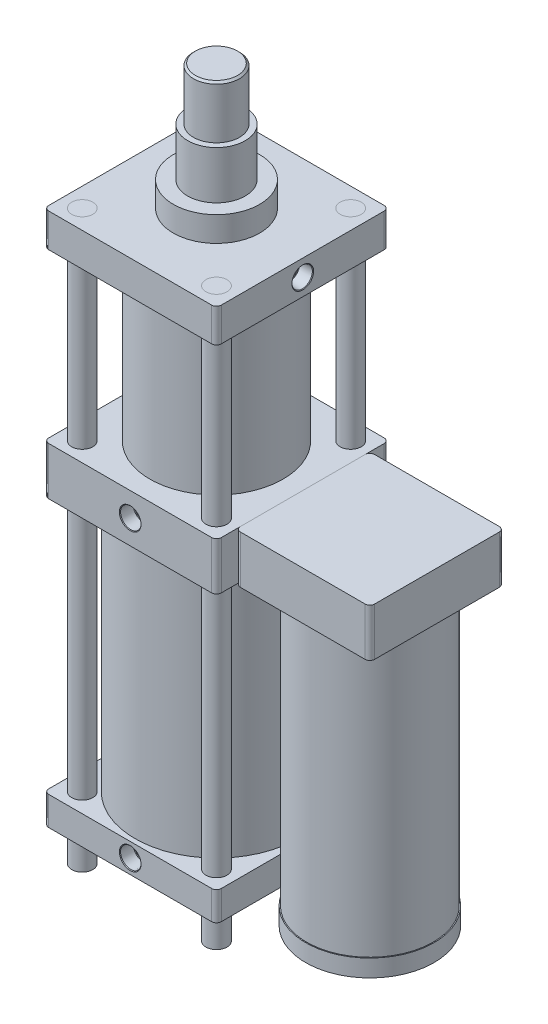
from build123d import *

# Parameters (mm, degrees)
SKETCH_1_R              = 11
EXTRUDE_1_DEPTH         = 35
SKETCH_2_R              = 45
EXTRUDE_2_DEPTH         = 26
SKETCH_3_R              = 30
EXTRUDE_3_DEPTH         = 50
SKETCH_4_R              = 24
EXTRUDE_4_DEPTH         = 55
CHAMFER_1_SIZE          = 2
SKETCH_5_R              = 69.5
EXTRUDE_5_DEPTH         = 175
EXTRUDE_START           = 50
SKETCH_6_R              = 11
EXTRUDE_6_DEPTH         = 50
SKETCH_7_R              = 85
EXTRUDE_7_DEPTH         = 267
EXTRUDE_START_2         = 30
SKETCH_8_R              = 11
EXTRUDE_8_DEPTH         = 30
EXTRUDE_9_DEPTH         = 50
SKETCH_10_R             = 66
EXTRUDE_10_DEPTH        = 290
SKETCH_11_R             = 67
EXTRUDE_11_DEPTH        = 18
EXTRUDE_12_DEPTH        = 12
EXTRUDE_13_DEPTH        = 35
EXTRUDE_13_DEPTH_BACK   = 557
SKETCH_13_R             = 11
EXTRUDE_13_2_DEPTH      = 35
EXTRUDE_13_2_DEPTH_BACK = 557
EXTRUDE_13_3_DEPTH      = 35
EXTRUDE_13_3_DEPTH_BACK = 557
EXTRUDE_13_4_DEPTH      = 35
EXTRUDE_13_4_DEPTH_BACK = 557
F_1_2_NPT_2_AT_2_COUNT  = 2
F_1_2_NPT_2_AT_2_PITCH  = 307


with BuildPart() as part:
    # Sketch 1 → Extrude 1 (new body)
    with BuildSketch(Plane(origin=(0, 0, 0), x_dir=(1, 0, 0), z_dir=(0, 1, 0))):
        with BuildLine():
            Line((85, 90), (-85, 90))
            ThreePointArc((-85, 90), (-88.535533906, 88.535533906), (-90, 85))
            Line((-90, 85), (-90, -85))
            ThreePointArc((-90, -85), (-88.535533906, -88.535533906), (-85, -90))
            Line((-85, -90), (85, -90))
            ThreePointArc((85, -90), (88.535533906, -88.535533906), (90, -85))
            Line((90, -85), (90, 85))
            ThreePointArc((90, 85), (88.535533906, 88.535533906), (85, 90))
        make_face()
        with Locations(Location((70, -70, 0), (0, 0, 270))):
            Circle(SKETCH_1_R, mode=Mode.SUBTRACT)
        with Locations(Location((-70, -70, 0), (0, 0, 270))):
            Circle(SKETCH_1_R, mode=Mode.SUBTRACT)
        with Locations(Location((-70, 70, 0), (0, 0, 270))):
            Circle(SKETCH_1_R, mode=Mode.SUBTRACT)
        with Locations(Location((70, 70, 0), (0, 0, 270))):
            Circle(SKETCH_1_R, mode=Mode.SUBTRACT)
    extrude(amount=EXTRUDE_1_DEPTH)

    # Sketch 2 → Extrude 2 (add)
    with BuildSketch(Plane(origin=(0, 35, 0), x_dir=(1, 0, 0), z_dir=(0, 1, 0))):
        with Locations(Location((0, 0, 0), (0, 0, 90))):
            Circle(SKETCH_2_R)
    extrude(amount=EXTRUDE_2_DEPTH)

    # Sketch 3 → Extrude 3 (add)
    with BuildSketch(Plane(origin=(0, 61, 0), x_dir=(1, 0, 0), z_dir=(0, 1, 0))):
        with Locations(Location((0, 0, 0), (0, 0, 270))):
            Circle(SKETCH_3_R)
    extrude(amount=EXTRUDE_3_DEPTH)

    # Sketch 4 → Extrude 4 (add)
    with BuildSketch(Plane(origin=(0, 111, 0), x_dir=(1, 0, 0), z_dir=(0, 1, 0))):
        with Locations(Location((0, 0, 0), (0, 0, 270))):
            Circle(SKETCH_4_R)
    extrude(amount=EXTRUDE_4_DEPTH)

    # Chamfer 1
    chamfer_1_edges = [part.edges().sort_by_distance(p)[0] for p in [
        (0, 166, -24),
    ]]
    chamfer(chamfer_1_edges, length=CHAMFER_1_SIZE)

    # Sketch 15 → 1_2 NPT _1 (revolve, cut)
    with BuildSketch(Plane(origin=(90, 17.5, 0), x_dir=(0, 0, -1), z_dir=(0, 1, 0))):
        Polygon((0, 0), (0, 28.004543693), (8.9281, 22.64), (8.9281, 13.57), (10.280670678, 13.57), (10.6679619, 0.635), (11.3029619, 0), align=None)
    revolve(axis=Axis((96.35, 17.5, 0), (-1, 0, 0)), mode=Mode.SUBTRACT)


with BuildPart() as body_2:
    # Sketch 5 → Extrude 5 (new body)
    with BuildSketch(Plane.XZ):
        with Locations(Location((0, 0, 0), (0, 0, 270))):
            Circle(SKETCH_5_R)
    extrude(amount=EXTRUDE_5_DEPTH)

    # Sketch 6 → Extrude 6 (add)
    with BuildSketch(Plane.XZ.offset(175).offset(EXTRUDE_START)):
        with BuildLine():
            Line((85, -90), (-85, -90))
            ThreePointArc((-85, -90), (-88.535533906, -88.535533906), (-90, -85))
            Line((-90, -85), (-90, 85))
            ThreePointArc((-90, 85), (-88.535533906, 88.535533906), (-85, 90))
            Line((-85, 90), (85, 90))
            ThreePointArc((85, 90), (88.535533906, 88.535533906), (90, 85))
            Line((90, 85), (90, -85))
            ThreePointArc((90, -85), (88.535533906, -88.535533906), (85, -90))
        make_face()
        with Locations(Location((70, -70, 0), (0, 0, 270))):
            Circle(SKETCH_6_R, mode=Mode.SUBTRACT)
        with Locations(Location((-70, -70, 0), (0, 0, 270))):
            Circle(SKETCH_6_R, mode=Mode.SUBTRACT)
        with Locations(Location((70, 70, 0), (0, 0, 270))):
            Circle(SKETCH_6_R, mode=Mode.SUBTRACT)
        with Locations(Location((-70, 70, 0), (0, 0, 270))):
            Circle(SKETCH_6_R, mode=Mode.SUBTRACT)
    extrude(amount=-EXTRUDE_6_DEPTH)

    # Sketch 7 → Extrude 7 (add)
    with BuildSketch(Plane.XZ.offset(225)):
        with Locations(Location((0, 0, 0), (0, 0, 270))):
            Circle(SKETCH_7_R)
    extrude(amount=EXTRUDE_7_DEPTH)

    # Sketch 8 → Extrude 8 (add)
    with BuildSketch(Plane.XZ.offset(492).offset(EXTRUDE_START_2)):
        with BuildLine():
            Line((-85, -90), (85, -90))
            ThreePointArc((85, -90), (88.535533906, -88.535533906), (90, -85))
            Line((90, -85), (90, 85))
            ThreePointArc((90, 85), (88.535533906, 88.535533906), (85, 90))
            Line((85, 90), (-85, 90))
            ThreePointArc((-85, 90), (-88.535533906, 88.535533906), (-90, 85))
            Line((-90, 85), (-90, -85))
            ThreePointArc((-90, -85), (-88.535533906, -88.535533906), (-85, -90))
        make_face()
        with Locations(Location((-70, -70, 0), (0, 0, 270))):
            Circle(SKETCH_8_R, mode=Mode.SUBTRACT)
        with Locations(Location((70, -70, 0), (0, 0, 270))):
            Circle(SKETCH_8_R, mode=Mode.SUBTRACT)
        with Locations(Location((70, 70, 0), (0, 0, 270))):
            Circle(SKETCH_8_R, mode=Mode.SUBTRACT)
        with Locations(Location((-70, 70, 0), (0, 0, 270))):
            Circle(SKETCH_8_R, mode=Mode.SUBTRACT)
    extrude(amount=-EXTRUDE_8_DEPTH)

    # Sketch 17 → 1_2 NPT _2 (revolve, cut)
    with BuildSketch(Plane(origin=(0, -200, 90), x_dir=(0, -1, 0), z_dir=(1, 0, 0))):
        Polygon((0, 0), (0, 28.004543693), (8.9281, 22.64), (8.9281, 13.57), (10.280670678, 13.57), (10.6679619, 0.635), (11.3029619, 0), align=None)
    f_1_2_npt_2 = revolve(axis=Axis((0, -200, 96.35), (0, 0, -1)), mode=Mode.SUBTRACT)

    # 1_2 NPT _2 at 2: 1_2 NPT _2 ×2
    with Locations(*[(0, -i * F_1_2_NPT_2_AT_2_PITCH, 0) for i in range(1, F_1_2_NPT_2_AT_2_COUNT)]):
        add(f_1_2_npt_2, mode=Mode.SUBTRACT)

    # Sketch 21 → 1_4 NPT _1 (revolve, cut)
    with BuildSketch(Plane(origin=(-90, -200, 0), x_dir=(0, 0, 1), z_dir=(0, 1, 0))):
        Polygon((0, 0), (0, 20.412347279), (5.5626, 17.07), (5.5626, 10.02), (6.576987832, 10.02), (6.8579873, 0.635), (7.4929873, 0), align=None)
    revolve(axis=Axis((-96.35, -200, 0), (1, 0, 0)), mode=Mode.SUBTRACT)

    # Sketch 23 → 1_4 NPT _2 (revolve, cut)
    with BuildSketch(Plane(origin=(0, -200, -90), x_dir=(0, 1, 0), z_dir=(1, 0, 0))):
        Polygon((0, 0), (0, 20.412347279), (5.5626, 17.07), (5.5626, 10.02), (6.576987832, 10.02), (6.8579873, 0.635), (7.4929873, 0), align=None)
    revolve(axis=Axis((0, -200, -96.35), (0, 0, 1)), mode=Mode.SUBTRACT)


with BuildPart() as body_3:
    # Sketch 9 → Extrude 9 (new body)
    with BuildSketch(Plane(origin=(0, -175, 0), x_dir=(1, 0, 0), z_dir=(0, 1, 0))):
        with BuildLine():
            Line((225, -70), (95, -70))
            ThreePointArc((95, -70), (91.464466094, -68.535533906), (90, -65))
            Line((90, -65), (90, 65))
            ThreePointArc((90, 65), (91.464466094, 68.535533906), (95, 70))
            Line((95, 70), (225, 70))
            ThreePointArc((225, 70), (228.535533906, 68.535533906), (230, 65))
            Line((230, 65), (230, -65))
            ThreePointArc((230, -65), (228.535533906, -68.535533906), (225, -70))
        make_face()
    extrude(amount=-EXTRUDE_9_DEPTH)


with BuildPart() as body_4:
    # Sketch 10 → Extrude 10 (new body)
    with BuildSketch(Plane.XZ.offset(225)):
        with Locations(Location((160, 0, 0), (0, 0, 270))):
            Circle(SKETCH_10_R)
    extrude(amount=EXTRUDE_10_DEPTH)


with BuildPart() as body_5:
    # Sketch 11 → Extrude 11 (new body)
    with BuildSketch(Plane.XZ.offset(515)):
        with Locations(Location((160, 0, 0), (0, 0, 270))):
            Circle(SKETCH_11_R)
    extrude(amount=EXTRUDE_11_DEPTH)


with BuildPart() as body_6:
    # Sketch 12 → Extrude 12 (new body)
    with BuildSketch(Plane.XZ.offset(533)):
        Polygon((177.320508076, 0), (168.660254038, 15), (151.339745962, 15), (142.679491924, 0), (151.339745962, -15), (168.660254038, -15), align=None)
    extrude(amount=EXTRUDE_12_DEPTH)


with BuildPart() as body_7:
    # Sketch 13 → Extrude 13 (new, two sides: drawn at the far end of the back side and taken through both)
    with BuildSketch(Plane.XZ.offset(522).offset(-EXTRUDE_13_DEPTH_BACK)):
        with Locations(Location((-70, -70, 0), (0, 0, 90))):
            Circle(SKETCH_13_R)
    extrude(amount=EXTRUDE_13_DEPTH + EXTRUDE_13_DEPTH_BACK)


with BuildPart() as body_8:
    # Sketch 13 → Extrude 13 2 (new, two sides: drawn at the far end of the back side and taken through both)
    with BuildSketch(Plane.XZ.offset(522).offset(-EXTRUDE_13_2_DEPTH_BACK)):
        with Locations(Location((-70, 70, 0), (0, 0, 90))):
            Circle(SKETCH_13_R)
    extrude(amount=EXTRUDE_13_2_DEPTH + EXTRUDE_13_2_DEPTH_BACK)


with BuildPart() as body_9:
    # Sketch 13 → Extrude 13 3 (new, two sides: drawn at the far end of the back side and taken through both)
    with BuildSketch(Plane.XZ.offset(522).offset(-EXTRUDE_13_3_DEPTH_BACK)):
        with Locations(Location((70, -70, 0), (0, 0, 90))):
            Circle(SKETCH_13_R)
    extrude(amount=EXTRUDE_13_3_DEPTH + EXTRUDE_13_3_DEPTH_BACK)


with BuildPart() as body_10:
    # Sketch 13 → Extrude 13 4 (new, two sides: drawn at the far end of the back side and taken through both)
    with BuildSketch(Plane.XZ.offset(522).offset(-EXTRUDE_13_4_DEPTH_BACK)):
        with Locations(Location((70, 70, 0), (0, 0, 90))):
            Circle(SKETCH_13_R)
    extrude(amount=EXTRUDE_13_4_DEPTH + EXTRUDE_13_4_DEPTH_BACK)


with BuildPart() as f_1_2_npt_3_tool:
    # Sketch 19 → 1_2 NPT _3 (revolve)
    with BuildSketch(Plane(origin=(160, -545, 0), x_dir=(0, 0, -1), z_dir=(1, 0, 0))):
        Polygon((0, 0), (0, 28.004543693), (8.9281, 22.64), (8.9281, 13.57), (10.280670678, 13.57), (10.6679619, 0.635), (11.3029619, 0), align=None)
    revolve(axis=Axis((160, -551.35, 0), (0, 1, 0)))


with BuildPart() as body_5_1:
    add(body_5.part)

    # 1_2 NPT _3: cut by f_1_2_npt_3_tool
    add(f_1_2_npt_3_tool.part, mode=Mode.SUBTRACT)


with BuildPart() as body_6_1:
    add(body_6.part)

    # 1_2 NPT _3: cut by f_1_2_npt_3_tool
    add(f_1_2_npt_3_tool.part, mode=Mode.SUBTRACT)


solid = Compound([part.part, body_2.part, body_3.part, body_4.part, body_7.part, body_8.part, body_9.part, body_10.part, body_5_1.part, body_6_1.part])
